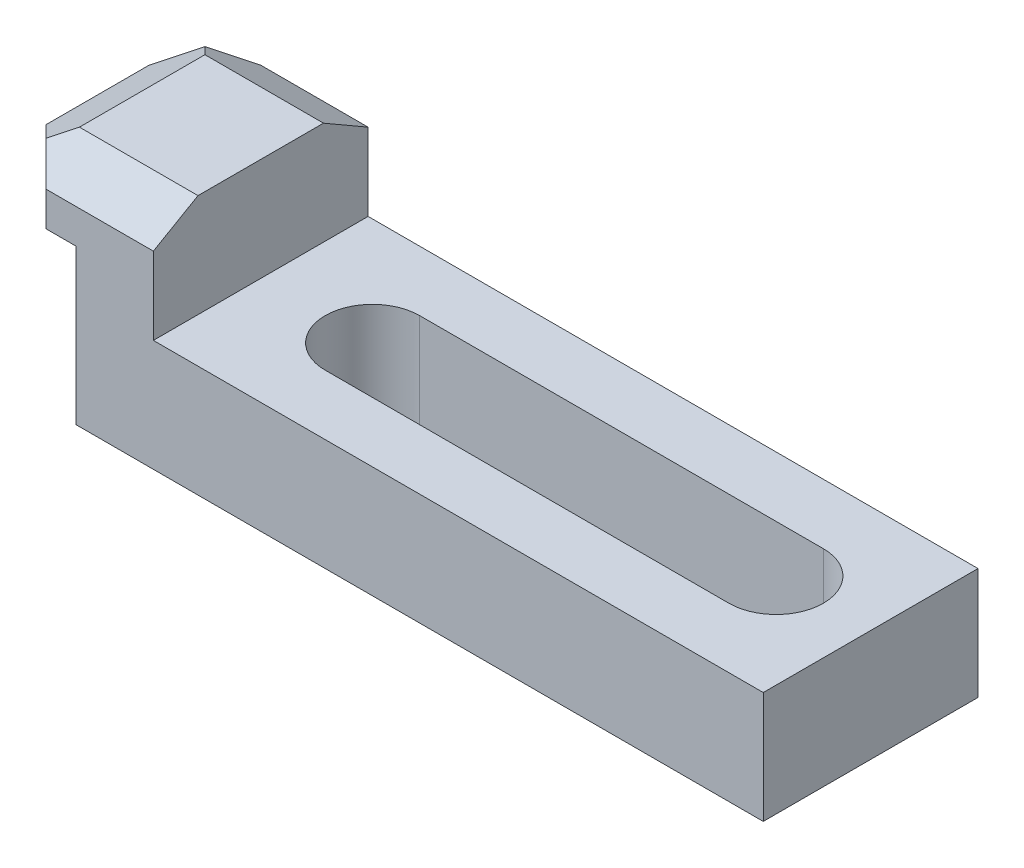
ISO-10303-21;
HEADER;
FILE_DESCRIPTION(('STEP AP214'),'2;1');
FILE_NAME('part.step','',(''),(''),'','','');
FILE_SCHEMA(('AUTOMOTIVE_DESIGN { 1 0 10303 214 1 1 1 1 }'));
ENDSEC;
DATA;
#1=APPLICATION_CONTEXT('core data for automotive mechanical design processes');
#2=APPLICATION_PROTOCOL_DEFINITION('international standard','automotive_design',2000,#1);
#3=PRODUCT_CONTEXT('',#1,'mechanical');
#4=PRODUCT('Part','Part','',(#3));
#5=PRODUCT_RELATED_PRODUCT_CATEGORY('part','',(#4));
#6=PRODUCT_DEFINITION_FORMATION('','',#4);
#7=PRODUCT_DEFINITION_CONTEXT('part definition',#1,'design');
#8=PRODUCT_DEFINITION('design','',#6,#7);
#9=PRODUCT_DEFINITION_SHAPE('','',#8);
#10=(LENGTH_UNIT() NAMED_UNIT(*) SI_UNIT(.MILLI.,.METRE.));
#11=(NAMED_UNIT(*) PLANE_ANGLE_UNIT() SI_UNIT($,.RADIAN.));
#12=(NAMED_UNIT(*) SI_UNIT($,.STERADIAN.) SOLID_ANGLE_UNIT());
#13=UNCERTAINTY_MEASURE_WITH_UNIT(LENGTH_MEASURE(1.E-05),#10,'distance_accuracy_value','');
#14=(GEOMETRIC_REPRESENTATION_CONTEXT(3) GLOBAL_UNCERTAINTY_ASSIGNED_CONTEXT((#13)) GLOBAL_UNIT_ASSIGNED_CONTEXT((#10,
#11,#12)) REPRESENTATION_CONTEXT('',''));
#15=CARTESIAN_POINT('',(0.,0.,0.));
#16=DIRECTION('',(0.,0.,1.));
#17=DIRECTION('',(1.,0.,0.));
#18=AXIS2_PLACEMENT_3D('',#15,#16,#17);
#19=CARTESIAN_POINT('',(0.,7.,12.5));
#20=DIRECTION('',(1.,0.,0.));
#21=DIRECTION('',(0.,1.,0.));
#22=AXIS2_PLACEMENT_3D('',#19,#20,#21);
#23=PLANE('',#22);
#24=DIRECTION('',(0.,0.,-1.));
#25=VECTOR('',#24,1.);
#26=CARTESIAN_POINT('',(0.,3.99999999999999,12.5));
#27=LINE('',#26,#25);
#28=CARTESIAN_POINT('',(0.,3.99999999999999,6.));
#29=VERTEX_POINT('',#28);
#30=CARTESIAN_POINT('',(0.,3.99999999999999,-6.));
#31=VERTEX_POINT('',#30);
#32=EDGE_CURVE('E171',#29,#31,#27,.T.);
#33=ORIENTED_EDGE('',*,*,#32,.T.);
#34=DIRECTION('',(0.,-1.,0.));
#35=VECTOR('',#34,1.);
#36=CARTESIAN_POINT('',(0.,7.,-6.));
#37=LINE('',#36,#35);
#38=CARTESIAN_POINT('',(0.,0.,-6.));
#39=VERTEX_POINT('',#38);
#40=EDGE_CURVE('E156',#31,#39,#37,.T.);
#41=ORIENTED_EDGE('',*,*,#40,.T.);
#42=DIRECTION('',(0.,0.,-1.));
#43=VECTOR('',#42,1.);
#44=CARTESIAN_POINT('',(0.,0.,12.5));
#45=LINE('',#44,#43);
#46=CARTESIAN_POINT('',(0.,0.,6.));
#47=VERTEX_POINT('',#46);
#48=EDGE_CURVE('E237',#47,#39,#45,.T.);
#49=ORIENTED_EDGE('',*,*,#48,.F.);
#50=DIRECTION('',(0.,-1.,0.));
#51=VECTOR('',#50,1.);
#52=CARTESIAN_POINT('',(0.,7.,6.));
#53=LINE('',#52,#51);
#54=EDGE_CURVE('E177',#29,#47,#53,.T.);
#55=ORIENTED_EDGE('',*,*,#54,.F.);
#56=EDGE_LOOP('',(#33,#41,#49,#55));
#57=FACE_BOUND('',#56,.T.);
#58=ADVANCED_FACE('F39',(#57),#23,.F.);
#59=CARTESIAN_POINT('',(0.,0.,12.5));
#60=DIRECTION('',(0.,1.,0.));
#61=DIRECTION('',(0.,0.,1.));
#62=AXIS2_PLACEMENT_3D('',#59,#60,#61);
#63=PLANE('',#62);
#64=ORIENTED_EDGE('',*,*,#48,.T.);
#65=DIRECTION('',(0.707106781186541,0.,-0.707106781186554));
#66=VECTOR('',#65,1.);
#67=CARTESIAN_POINT('',(-9.25,0.,3.25000000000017));
#68=LINE('',#67,#66);
#69=CARTESIAN_POINT('',(6.49999999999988,0.,-12.5));
#70=VERTEX_POINT('',#69);
#71=EDGE_CURVE('E159',#39,#70,#68,.T.);
#72=ORIENTED_EDGE('',*,*,#71,.T.);
#73=DIRECTION('',(1.,0.,0.));
#74=VECTOR('',#73,1.);
#75=CARTESIAN_POINT('',(0.,0.,-12.5));
#76=LINE('',#75,#74);
#77=CARTESIAN_POINT('',(10.,0.,-12.5));
#78=VERTEX_POINT('',#77);
#79=EDGE_CURVE('E198',#70,#78,#76,.T.);
#80=ORIENTED_EDGE('',*,*,#79,.T.);
#81=DIRECTION('',(0.,0.,-1.));
#82=VECTOR('',#81,1.);
#83=CARTESIAN_POINT('',(10.,0.,12.5));
#84=LINE('',#83,#82);
#85=CARTESIAN_POINT('',(10.,0.,12.5));
#86=VERTEX_POINT('',#85);
#87=EDGE_CURVE('E354',#86,#78,#84,.T.);
#88=ORIENTED_EDGE('',*,*,#87,.F.);
#89=DIRECTION('',(1.,0.,0.));
#90=VECTOR('',#89,1.);
#91=CARTESIAN_POINT('',(0.,0.,12.5));
#92=LINE('',#91,#90);
#93=CARTESIAN_POINT('',(6.49999999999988,0.,12.5));
#94=VERTEX_POINT('',#93);
#95=EDGE_CURVE('E310',#94,#86,#92,.T.);
#96=ORIENTED_EDGE('',*,*,#95,.F.);
#97=DIRECTION('',(-0.707106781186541,0.,-0.707106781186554));
#98=VECTOR('',#97,1.);
#99=CARTESIAN_POINT('',(3.25,0.,9.25000000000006));
#100=LINE('',#99,#98);
#101=EDGE_CURVE('E282',#94,#47,#100,.T.);
#102=ORIENTED_EDGE('',*,*,#101,.T.);
#103=EDGE_LOOP('',(#64,#72,#80,#88,#96,#102));
#104=FACE_BOUND('',#103,.T.);
#105=ADVANCED_FACE('F358',(#104),#63,.F.);
#106=CARTESIAN_POINT('',(10.,0.,12.5));
#107=DIRECTION('',(1.,0.,0.));
#108=DIRECTION('',(0.,1.,0.));
#109=AXIS2_PLACEMENT_3D('',#106,#107,#108);
#110=PLANE('',#109);
#111=DIRECTION('',(0.,-1.,0.));
#112=VECTOR('',#111,1.);
#113=CARTESIAN_POINT('',(10.,0.,-12.5));
#114=LINE('',#113,#112);
#115=CARTESIAN_POINT('',(10.,-18.,-12.5));
#116=VERTEX_POINT('',#115);
#117=EDGE_CURVE('E328',#78,#116,#114,.T.);
#118=ORIENTED_EDGE('',*,*,#117,.T.);
#119=DIRECTION('',(0.,0.,-1.));
#120=VECTOR('',#119,1.);
#121=CARTESIAN_POINT('',(10.,-18.,12.5));
#122=LINE('',#121,#120);
#123=CARTESIAN_POINT('',(10.,-18.,12.5));
#124=VERTEX_POINT('',#123);
#125=EDGE_CURVE('E351',#124,#116,#122,.T.);
#126=ORIENTED_EDGE('',*,*,#125,.F.);
#127=DIRECTION('',(0.,-1.,0.));
#128=VECTOR('',#127,1.);
#129=CARTESIAN_POINT('',(10.,0.,12.5));
#130=LINE('',#129,#128);
#131=EDGE_CURVE('E313',#86,#124,#130,.T.);
#132=ORIENTED_EDGE('',*,*,#131,.F.);
#133=ORIENTED_EDGE('',*,*,#87,.T.);
#134=EDGE_LOOP('',(#118,#126,#132,#133));
#135=FACE_BOUND('',#134,.T.);
#136=ADVANCED_FACE('F381',(#135),#110,.F.);
#137=CARTESIAN_POINT('',(10.,-18.,12.5));
#138=DIRECTION('',(0.,1.,0.));
#139=DIRECTION('',(0.,0.,1.));
#140=AXIS2_PLACEMENT_3D('',#137,#138,#139);
#141=PLANE('',#140);
#142=DIRECTION('',(1.,0.,0.));
#143=VECTOR('',#142,1.);
#144=CARTESIAN_POINT('',(32.,-18.,-5.5));
#145=LINE('',#144,#143);
#146=CARTESIAN_POINT('',(32.,-18.,-5.5));
#147=VERTEX_POINT('',#146);
#148=CARTESIAN_POINT('',(79.,-18.,-5.5));
#149=VERTEX_POINT('',#148);
#150=EDGE_CURVE('E288',#147,#149,#145,.T.);
#151=ORIENTED_EDGE('',*,*,#150,.F.);
#152=CARTESIAN_POINT('',(32.,-18.,0.));
#153=DIRECTION('',(0.,-1.,0.));
#154=DIRECTION('',(0.,0.,-1.));
#155=AXIS2_PLACEMENT_3D('',#152,#153,#154);
#156=CIRCLE('',#155,5.5);
#157=CARTESIAN_POINT('',(32.,-18.,5.5));
#158=VERTEX_POINT('',#157);
#159=EDGE_CURVE('E285',#158,#147,#156,.T.);
#160=ORIENTED_EDGE('',*,*,#159,.F.);
#161=DIRECTION('',(-1.,0.,0.));
#162=VECTOR('',#161,1.);
#163=CARTESIAN_POINT('',(32.,-18.,5.5));
#164=LINE('',#163,#162);
#165=CARTESIAN_POINT('',(79.,-18.,5.5));
#166=VERTEX_POINT('',#165);
#167=EDGE_CURVE('E296',#166,#158,#164,.T.);
#168=ORIENTED_EDGE('',*,*,#167,.F.);
#169=CARTESIAN_POINT('',(79.,-18.,0.));
#170=DIRECTION('',(0.,-1.,0.));
#171=DIRECTION('',(0.,0.,-1.));
#172=AXIS2_PLACEMENT_3D('',#169,#170,#171);
#173=CIRCLE('',#172,5.5);
#174=EDGE_CURVE('E292',#149,#166,#173,.T.);
#175=ORIENTED_EDGE('',*,*,#174,.F.);
#176=EDGE_LOOP('',(#151,#160,#168,#175));
#177=FACE_BOUND('',#176,.T.);
#178=DIRECTION('',(1.,0.,0.));
#179=VECTOR('',#178,1.);
#180=CARTESIAN_POINT('',(10.,-18.,-12.5));
#181=LINE('',#180,#179);
#182=CARTESIAN_POINT('',(90.,-18.,-12.5));
#183=VERTEX_POINT('',#182);
#184=EDGE_CURVE('E331',#116,#183,#181,.T.);
#185=ORIENTED_EDGE('',*,*,#184,.T.);
#186=DIRECTION('',(0.,0.,-1.));
#187=VECTOR('',#186,1.);
#188=CARTESIAN_POINT('',(90.,-18.,12.5));
#189=LINE('',#188,#187);
#190=CARTESIAN_POINT('',(90.,-18.,12.5));
#191=VERTEX_POINT('',#190);
#192=EDGE_CURVE('E347',#191,#183,#189,.T.);
#193=ORIENTED_EDGE('',*,*,#192,.F.);
#194=DIRECTION('',(1.,0.,0.));
#195=VECTOR('',#194,1.);
#196=CARTESIAN_POINT('',(10.,-18.,12.5));
#197=LINE('',#196,#195);
#198=EDGE_CURVE('E315',#124,#191,#197,.T.);
#199=ORIENTED_EDGE('',*,*,#198,.F.);
#200=ORIENTED_EDGE('',*,*,#125,.T.);
#201=EDGE_LOOP('',(#185,#193,#199,#200));
#202=FACE_BOUND('',#201,.T.);
#203=ADVANCED_FACE('F378',(#177,#202),#141,.F.);
#204=CARTESIAN_POINT('',(90.,-18.,12.5));
#205=DIRECTION('',(-1.,0.,0.));
#206=DIRECTION('',(0.,0.,1.));
#207=AXIS2_PLACEMENT_3D('',#204,#205,#206);
#208=PLANE('',#207);
#209=DIRECTION('',(0.,1.,0.));
#210=VECTOR('',#209,1.);
#211=CARTESIAN_POINT('',(90.,-18.,-12.5));
#212=LINE('',#211,#210);
#213=CARTESIAN_POINT('',(90.,-5.,-12.5));
#214=VERTEX_POINT('',#213);
#215=EDGE_CURVE('E334',#183,#214,#212,.T.);
#216=ORIENTED_EDGE('',*,*,#215,.T.);
#217=DIRECTION('',(0.,0.,-1.));
#218=VECTOR('',#217,1.);
#219=CARTESIAN_POINT('',(90.,-5.,12.5));
#220=LINE('',#219,#218);
#221=CARTESIAN_POINT('',(90.,-5.,12.5));
#222=VERTEX_POINT('',#221);
#223=EDGE_CURVE('E344',#222,#214,#220,.T.);
#224=ORIENTED_EDGE('',*,*,#223,.F.);
#225=DIRECTION('',(0.,1.,0.));
#226=VECTOR('',#225,1.);
#227=CARTESIAN_POINT('',(90.,-18.,12.5));
#228=LINE('',#227,#226);
#229=EDGE_CURVE('E317',#191,#222,#228,.T.);
#230=ORIENTED_EDGE('',*,*,#229,.F.);
#231=ORIENTED_EDGE('',*,*,#192,.T.);
#232=EDGE_LOOP('',(#216,#224,#230,#231));
#233=FACE_BOUND('',#232,.T.);
#234=ADVANCED_FACE('F374',(#233),#208,.F.);
#235=CARTESIAN_POINT('',(90.,-5.,12.5));
#236=DIRECTION('',(0.,-1.,0.));
#237=DIRECTION('',(1.,0.,0.));
#238=AXIS2_PLACEMENT_3D('',#235,#236,#237);
#239=PLANE('',#238);
#240=DIRECTION('',(-1.,0.,0.));
#241=VECTOR('',#240,1.);
#242=CARTESIAN_POINT('',(90.,-5.,5.5));
#243=LINE('',#242,#241);
#244=CARTESIAN_POINT('',(79.,-5.,5.5));
#245=VERTEX_POINT('',#244);
#246=CARTESIAN_POINT('',(32.,-5.,5.5));
#247=VERTEX_POINT('',#246);
#248=EDGE_CURVE('E203',#245,#247,#243,.T.);
#249=ORIENTED_EDGE('',*,*,#248,.T.);
#250=CARTESIAN_POINT('',(32.,-5.00000000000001,0.));
#251=DIRECTION('',(0.,-1.,0.));
#252=DIRECTION('',(1.,0.,0.));
#253=AXIS2_PLACEMENT_3D('',#250,#251,#252);
#254=CIRCLE('',#253,5.5);
#255=CARTESIAN_POINT('',(32.,-5.,-5.5));
#256=VERTEX_POINT('',#255);
#257=EDGE_CURVE('E207',#247,#256,#254,.T.);
#258=ORIENTED_EDGE('',*,*,#257,.T.);
#259=DIRECTION('',(1.,0.,0.));
#260=VECTOR('',#259,1.);
#261=CARTESIAN_POINT('',(90.,-5.,-5.5));
#262=LINE('',#261,#260);
#263=CARTESIAN_POINT('',(79.,-5.,-5.5));
#264=VERTEX_POINT('',#263);
#265=EDGE_CURVE('E179',#256,#264,#262,.T.);
#266=ORIENTED_EDGE('',*,*,#265,.T.);
#267=CARTESIAN_POINT('',(79.,-5.,0.));
#268=DIRECTION('',(0.,-1.,0.));
#269=DIRECTION('',(1.,0.,0.));
#270=AXIS2_PLACEMENT_3D('',#267,#268,#269);
#271=CIRCLE('',#270,5.5);
#272=EDGE_CURVE('E185',#264,#245,#271,.T.);
#273=ORIENTED_EDGE('',*,*,#272,.T.);
#274=EDGE_LOOP('',(#249,#258,#266,#273));
#275=FACE_BOUND('',#274,.T.);
#276=DIRECTION('',(-1.,0.,0.));
#277=VECTOR('',#276,1.);
#278=CARTESIAN_POINT('',(90.,-5.,-12.5));
#279=LINE('',#278,#277);
#280=CARTESIAN_POINT('',(19.,-5.00000000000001,-12.5));
#281=VERTEX_POINT('',#280);
#282=EDGE_CURVE('E337',#214,#281,#279,.T.);
#283=ORIENTED_EDGE('',*,*,#282,.T.);
#284=DIRECTION('',(0.,0.,-1.));
#285=VECTOR('',#284,1.);
#286=CARTESIAN_POINT('',(19.,-5.00000000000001,12.5));
#287=LINE('',#286,#285);
#288=CARTESIAN_POINT('',(19.,-5.00000000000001,12.5));
#289=VERTEX_POINT('',#288);
#290=EDGE_CURVE('E259',#289,#281,#287,.T.);
#291=ORIENTED_EDGE('',*,*,#290,.F.);
#292=DIRECTION('',(-1.,0.,0.));
#293=VECTOR('',#292,1.);
#294=CARTESIAN_POINT('',(90.,-5.,12.5));
#295=LINE('',#294,#293);
#296=EDGE_CURVE('E320',#222,#289,#295,.T.);
#297=ORIENTED_EDGE('',*,*,#296,.F.);
#298=ORIENTED_EDGE('',*,*,#223,.T.);
#299=EDGE_LOOP('',(#283,#291,#297,#298));
#300=FACE_BOUND('',#299,.T.);
#301=ADVANCED_FACE('F370',(#275,#300),#239,.F.);
#302=CARTESIAN_POINT('',(19.,-5.00000000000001,12.5));
#303=DIRECTION('',(-1.,0.,0.));
#304=DIRECTION('',(0.,-1.,0.));
#305=AXIS2_PLACEMENT_3D('',#302,#303,#304);
#306=PLANE('',#305);
#307=DIRECTION('',(0.,1.,0.));
#308=VECTOR('',#307,1.);
#309=CARTESIAN_POINT('',(19.,-5.00000000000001,-12.5));
#310=LINE('',#309,#308);
#311=CARTESIAN_POINT('',(19.,3.99999999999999,-12.5));
#312=VERTEX_POINT('',#311);
#313=EDGE_CURVE('E253',#281,#312,#310,.T.);
#314=ORIENTED_EDGE('',*,*,#313,.T.);
#315=DIRECTION('',(0.,-0.500000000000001,-0.866025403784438));
#316=VECTOR('',#315,1.);
#317=CARTESIAN_POINT('',(19.,7.,-7.30384757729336));
#318=LINE('',#317,#316);
#319=CARTESIAN_POINT('',(19.,7.,-7.30384757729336));
#320=VERTEX_POINT('',#319);
#321=EDGE_CURVE('E189',#312,#320,#318,.F.);
#322=ORIENTED_EDGE('',*,*,#321,.T.);
#323=DIRECTION('',(0.,0.,-1.));
#324=VECTOR('',#323,1.);
#325=CARTESIAN_POINT('',(19.,7.,12.5));
#326=LINE('',#325,#324);
#327=CARTESIAN_POINT('',(19.,7.,7.30384757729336));
#328=VERTEX_POINT('',#327);
#329=EDGE_CURVE('E250',#328,#320,#326,.T.);
#330=ORIENTED_EDGE('',*,*,#329,.F.);
#331=DIRECTION('',(0.,-0.500000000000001,0.866025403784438));
#332=VECTOR('',#331,1.);
#333=CARTESIAN_POINT('',(19.,3.99999999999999,12.5));
#334=LINE('',#333,#332);
#335=CARTESIAN_POINT('',(19.,3.99999999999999,12.5));
#336=VERTEX_POINT('',#335);
#337=EDGE_CURVE('E222',#328,#336,#334,.T.);
#338=ORIENTED_EDGE('',*,*,#337,.T.);
#339=DIRECTION('',(0.,1.,0.));
#340=VECTOR('',#339,1.);
#341=CARTESIAN_POINT('',(19.,-5.00000000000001,12.5));
#342=LINE('',#341,#340);
#343=EDGE_CURVE('E260',#289,#336,#342,.T.);
#344=ORIENTED_EDGE('',*,*,#343,.F.);
#345=ORIENTED_EDGE('',*,*,#290,.T.);
#346=EDGE_LOOP('',(#314,#322,#330,#338,#344,#345));
#347=FACE_BOUND('',#346,.T.);
#348=ADVANCED_FACE('F249',(#347),#306,.F.);
#349=CARTESIAN_POINT('',(19.,7.,12.5));
#350=DIRECTION('',(0.,-1.,0.));
#351=DIRECTION('',(1.,0.,0.));
#352=AXIS2_PLACEMENT_3D('',#349,#350,#351);
#353=PLANE('',#352);
#354=ORIENTED_EDGE('',*,*,#329,.T.);
#355=DIRECTION('',(-1.,0.,0.));
#356=VECTOR('',#355,1.);
#357=CARTESIAN_POINT('',(19.,7.,-7.30384757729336));
#358=LINE('',#357,#356);
#359=CARTESIAN_POINT('',(5.19615242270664,7.,-7.30384757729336));
#360=VERTEX_POINT('',#359);
#361=EDGE_CURVE('E227',#320,#360,#358,.T.);
#362=ORIENTED_EDGE('',*,*,#361,.T.);
#363=DIRECTION('',(0.,0.,1.));
#364=VECTOR('',#363,1.);
#365=CARTESIAN_POINT('',(5.19615242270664,7.,12.5));
#366=LINE('',#365,#364);
#367=CARTESIAN_POINT('',(5.19615242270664,7.,7.30384757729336));
#368=VERTEX_POINT('',#367);
#369=EDGE_CURVE('E228',#360,#368,#366,.T.);
#370=ORIENTED_EDGE('',*,*,#369,.T.);
#371=DIRECTION('',(1.,0.,0.));
#372=VECTOR('',#371,1.);
#373=CARTESIAN_POINT('',(19.,7.,7.30384757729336));
#374=LINE('',#373,#372);
#375=EDGE_CURVE('E221',#368,#328,#374,.T.);
#376=ORIENTED_EDGE('',*,*,#375,.T.);
#377=EDGE_LOOP('',(#354,#362,#370,#376));
#378=FACE_BOUND('',#377,.T.);
#379=ADVANCED_FACE('F257',(#378),#353,.F.);
#380=CARTESIAN_POINT('',(0.,0.,12.5));
#381=DIRECTION('',(0.,0.,1.));
#382=DIRECTION('',(1.,0.,0.));
#383=AXIS2_PLACEMENT_3D('',#380,#381,#382);
#384=PLANE('',#383);
#385=DIRECTION('',(0.,-1.,0.));
#386=VECTOR('',#385,1.);
#387=CARTESIAN_POINT('',(6.49999999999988,7.,12.5));
#388=LINE('',#387,#386);
#389=CARTESIAN_POINT('',(6.49999999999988,3.99999999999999,12.5));
#390=VERTEX_POINT('',#389);
#391=EDGE_CURVE('E274',#390,#94,#388,.T.);
#392=ORIENTED_EDGE('',*,*,#391,.T.);
#393=ORIENTED_EDGE('',*,*,#95,.T.);
#394=ORIENTED_EDGE('',*,*,#131,.T.);
#395=ORIENTED_EDGE('',*,*,#198,.T.);
#396=ORIENTED_EDGE('',*,*,#229,.T.);
#397=ORIENTED_EDGE('',*,*,#296,.T.);
#398=ORIENTED_EDGE('',*,*,#343,.T.);
#399=DIRECTION('',(-1.,0.,0.));
#400=VECTOR('',#399,1.);
#401=CARTESIAN_POINT('',(0.,3.99999999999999,12.5));
#402=LINE('',#401,#400);
#403=EDGE_CURVE('E180',#336,#390,#402,.T.);
#404=ORIENTED_EDGE('',*,*,#403,.T.);
#405=EDGE_LOOP('',(#392,#393,#394,#395,#396,#397,#398,#404));
#406=FACE_BOUND('',#405,.T.);
#407=ADVANCED_FACE('F362',(#406),#384,.T.);
#408=CARTESIAN_POINT('',(0.,0.,-12.5));
#409=DIRECTION('',(0.,0.,1.));
#410=DIRECTION('',(1.,0.,0.));
#411=AXIS2_PLACEMENT_3D('',#408,#409,#410);
#412=PLANE('',#411);
#413=ORIENTED_EDGE('',*,*,#79,.F.);
#414=DIRECTION('',(0.,-1.,0.));
#415=VECTOR('',#414,1.);
#416=CARTESIAN_POINT('',(6.49999999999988,7.,-12.5));
#417=LINE('',#416,#415);
#418=CARTESIAN_POINT('',(6.49999999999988,3.99999999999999,-12.5));
#419=VERTEX_POINT('',#418);
#420=EDGE_CURVE('E165',#419,#70,#417,.T.);
#421=ORIENTED_EDGE('',*,*,#420,.F.);
#422=DIRECTION('',(1.,0.,0.));
#423=VECTOR('',#422,1.);
#424=CARTESIAN_POINT('',(0.,3.99999999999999,-12.5));
#425=LINE('',#424,#423);
#426=EDGE_CURVE('E234',#419,#312,#425,.T.);
#427=ORIENTED_EDGE('',*,*,#426,.T.);
#428=ORIENTED_EDGE('',*,*,#313,.F.);
#429=ORIENTED_EDGE('',*,*,#282,.F.);
#430=ORIENTED_EDGE('',*,*,#215,.F.);
#431=ORIENTED_EDGE('',*,*,#184,.F.);
#432=ORIENTED_EDGE('',*,*,#117,.F.);
#433=EDGE_LOOP('',(#413,#421,#427,#428,#429,#430,#431,#432));
#434=FACE_BOUND('',#433,.T.);
#435=ADVANCED_FACE('F266',(#434),#412,.F.);
#436=CARTESIAN_POINT('',(0.,3.99999999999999,12.5));
#437=DIRECTION('',(0.,0.866025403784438,0.500000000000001));
#438=DIRECTION('',(0.,-0.500000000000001,0.866025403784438));
#439=AXIS2_PLACEMENT_3D('',#436,#437,#438);
#440=PLANE('',#439);
#441=DIRECTION('',(-0.65465367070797,0.377964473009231,-0.654653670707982));
#442=VECTOR('',#441,1.);
#443=CARTESIAN_POINT('',(3.71428571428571,5.60833289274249,9.71428571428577));
#444=LINE('',#443,#442);
#445=CARTESIAN_POINT('',(3.24999999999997,5.87638837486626,9.25000000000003));
#446=VERTEX_POINT('',#445);
#447=EDGE_CURVE('E62',#390,#446,#444,.T.);
#448=ORIENTED_EDGE('',*,*,#447,.F.);
#449=ORIENTED_EDGE('',*,*,#403,.F.);
#450=ORIENTED_EDGE('',*,*,#337,.F.);
#451=ORIENTED_EDGE('',*,*,#375,.F.);
#452=DIRECTION('',(-0.654653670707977,-0.377964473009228,0.654653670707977));
#453=VECTOR('',#452,1.);
#454=CARTESIAN_POINT('',(0.,3.99999999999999,12.5));
#455=LINE('',#454,#453);
#456=EDGE_CURVE('E195',#446,#368,#455,.F.);
#457=ORIENTED_EDGE('',*,*,#456,.F.);
#458=EDGE_LOOP('',(#448,#449,#450,#451,#457));
#459=FACE_BOUND('',#458,.T.);
#460=ADVANCED_FACE('F41',(#459),#440,.T.);
#461=CARTESIAN_POINT('',(0.,3.99999999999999,12.5));
#462=DIRECTION('',(0.5,-0.866025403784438,0.));
#463=DIRECTION('',(0.866025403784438,0.5,0.));
#464=AXIS2_PLACEMENT_3D('',#461,#462,#463);
#465=PLANE('',#464);
#466=DIRECTION('',(-0.654653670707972,-0.377964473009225,0.654653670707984));
#467=VECTOR('',#466,1.);
#468=CARTESIAN_POINT('',(-7.92857142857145,-0.577562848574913,1.92857142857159));
#469=LINE('',#468,#467);
#470=CARTESIAN_POINT('',(3.24999999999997,5.87638837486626,-9.25000000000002));
#471=VERTEX_POINT('',#470);
#472=EDGE_CURVE('E54',#31,#471,#469,.F.);
#473=ORIENTED_EDGE('',*,*,#472,.F.);
#474=ORIENTED_EDGE('',*,*,#32,.F.);
#475=DIRECTION('',(0.654653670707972,0.377964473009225,0.654653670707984));
#476=VECTOR('',#475,1.);
#477=CARTESIAN_POINT('',(2.78571428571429,5.60833289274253,8.78571428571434));
#478=LINE('',#477,#476);
#479=EDGE_CURVE('E48',#446,#29,#478,.F.);
#480=ORIENTED_EDGE('',*,*,#479,.F.);
#481=ORIENTED_EDGE('',*,*,#456,.T.);
#482=ORIENTED_EDGE('',*,*,#369,.F.);
#483=DIRECTION('',(-0.654653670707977,-0.377964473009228,-0.654653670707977));
#484=VECTOR('',#483,1.);
#485=CARTESIAN_POINT('',(10.7142857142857,10.1858957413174,-1.78571428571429));
#486=LINE('',#485,#484);
#487=EDGE_CURVE('E173',#471,#360,#486,.F.);
#488=ORIENTED_EDGE('',*,*,#487,.F.);
#489=EDGE_LOOP('',(#473,#474,#480,#481,#482,#488));
#490=FACE_BOUND('',#489,.T.);
#491=ADVANCED_FACE('F170',(#490),#465,.F.);
#492=CARTESIAN_POINT('',(19.,7.,-7.30384757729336));
#493=DIRECTION('',(0.,-0.866025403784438,0.500000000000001));
#494=DIRECTION('',(0.,-0.500000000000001,-0.866025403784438));
#495=AXIS2_PLACEMENT_3D('',#492,#493,#494);
#496=PLANE('',#495);
#497=DIRECTION('',(-0.65465367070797,0.377964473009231,0.654653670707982));
#498=VECTOR('',#497,1.);
#499=CARTESIAN_POINT('',(8.88791290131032,2.62133784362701,-14.8879129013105));
#500=LINE('',#499,#498);
#501=EDGE_CURVE('E11',#471,#419,#500,.F.);
#502=ORIENTED_EDGE('',*,*,#501,.F.);
#503=ORIENTED_EDGE('',*,*,#487,.T.);
#504=ORIENTED_EDGE('',*,*,#361,.F.);
#505=ORIENTED_EDGE('',*,*,#321,.F.);
#506=ORIENTED_EDGE('',*,*,#426,.F.);
#507=EDGE_LOOP('',(#502,#503,#504,#505,#506));
#508=FACE_BOUND('',#507,.T.);
#509=ADVANCED_FACE('F262',(#508),#496,.F.);
#510=CARTESIAN_POINT('',(32.,7.,0.));
#511=DIRECTION('',(0.,-1.,0.));
#512=DIRECTION('',(0.,0.,-1.));
#513=AXIS2_PLACEMENT_3D('',#510,#511,#512);
#514=CYLINDRICAL_SURFACE('',#513,5.5);
#515=DIRECTION('',(0.,-1.,0.));
#516=VECTOR('',#515,1.);
#517=CARTESIAN_POINT('',(32.,7.,5.5));
#518=LINE('',#517,#516);
#519=EDGE_CURVE('E196',#247,#158,#518,.T.);
#520=ORIENTED_EDGE('',*,*,#519,.T.);
#521=ORIENTED_EDGE('',*,*,#159,.T.);
#522=DIRECTION('',(0.,-1.,0.));
#523=VECTOR('',#522,1.);
#524=CARTESIAN_POINT('',(32.,7.,-5.5));
#525=LINE('',#524,#523);
#526=EDGE_CURVE('E300',#256,#147,#525,.T.);
#527=ORIENTED_EDGE('',*,*,#526,.F.);
#528=ORIENTED_EDGE('',*,*,#257,.F.);
#529=EDGE_LOOP('',(#520,#521,#527,#528));
#530=FACE_BOUND('',#529,.T.);
#531=ADVANCED_FACE('F398',(#530),#514,.F.);
#532=CARTESIAN_POINT('',(32.,7.,5.5));
#533=DIRECTION('',(0.,0.,1.));
#534=DIRECTION('',(1.,0.,0.));
#535=AXIS2_PLACEMENT_3D('',#532,#533,#534);
#536=PLANE('',#535);
#537=DIRECTION('',(0.,-1.,0.));
#538=VECTOR('',#537,1.);
#539=CARTESIAN_POINT('',(79.,7.,5.5));
#540=LINE('',#539,#538);
#541=EDGE_CURVE('E302',#245,#166,#540,.T.);
#542=ORIENTED_EDGE('',*,*,#541,.T.);
#543=ORIENTED_EDGE('',*,*,#167,.T.);
#544=ORIENTED_EDGE('',*,*,#519,.F.);
#545=ORIENTED_EDGE('',*,*,#248,.F.);
#546=EDGE_LOOP('',(#542,#543,#544,#545));
#547=FACE_BOUND('',#546,.T.);
#548=ADVANCED_FACE('F458',(#547),#536,.F.);
#549=CARTESIAN_POINT('',(79.,7.,0.));
#550=DIRECTION('',(0.,-1.,0.));
#551=DIRECTION('',(0.,0.,-1.));
#552=AXIS2_PLACEMENT_3D('',#549,#550,#551);
#553=CYLINDRICAL_SURFACE('',#552,5.5);
#554=DIRECTION('',(0.,-1.,0.));
#555=VECTOR('',#554,1.);
#556=CARTESIAN_POINT('',(79.,7.,-5.5));
#557=LINE('',#556,#555);
#558=EDGE_CURVE('E304',#264,#149,#557,.T.);
#559=ORIENTED_EDGE('',*,*,#558,.T.);
#560=ORIENTED_EDGE('',*,*,#174,.T.);
#561=ORIENTED_EDGE('',*,*,#541,.F.);
#562=ORIENTED_EDGE('',*,*,#272,.F.);
#563=EDGE_LOOP('',(#559,#560,#561,#562));
#564=FACE_BOUND('',#563,.T.);
#565=ADVANCED_FACE('F466',(#564),#553,.F.);
#566=CARTESIAN_POINT('',(32.,7.,-5.5));
#567=DIRECTION('',(0.,0.,-1.));
#568=DIRECTION('',(-1.,0.,0.));
#569=AXIS2_PLACEMENT_3D('',#566,#567,#568);
#570=PLANE('',#569);
#571=ORIENTED_EDGE('',*,*,#526,.T.);
#572=ORIENTED_EDGE('',*,*,#150,.T.);
#573=ORIENTED_EDGE('',*,*,#558,.F.);
#574=ORIENTED_EDGE('',*,*,#265,.F.);
#575=EDGE_LOOP('',(#571,#572,#573,#574));
#576=FACE_BOUND('',#575,.T.);
#577=ADVANCED_FACE('F475',(#576),#570,.F.);
#578=CARTESIAN_POINT('',(6.49999999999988,7.,12.5));
#579=DIRECTION('',(0.707106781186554,0.,-0.707106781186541));
#580=DIRECTION('',(-0.707106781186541,0.,-0.707106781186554));
#581=AXIS2_PLACEMENT_3D('',#578,#579,#580);
#582=PLANE('',#581);
#583=ORIENTED_EDGE('',*,*,#391,.F.);
#584=ORIENTED_EDGE('',*,*,#447,.T.);
#585=ORIENTED_EDGE('',*,*,#479,.T.);
#586=ORIENTED_EDGE('',*,*,#54,.T.);
#587=ORIENTED_EDGE('',*,*,#101,.F.);
#588=EDGE_LOOP('',(#583,#584,#585,#586,#587));
#589=FACE_BOUND('',#588,.T.);
#590=ADVANCED_FACE('F213',(#589),#582,.F.);
#591=CARTESIAN_POINT('',(6.49999999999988,7.,-12.5));
#592=DIRECTION('',(0.707106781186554,0.,0.707106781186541));
#593=DIRECTION('',(0.707106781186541,0.,-0.707106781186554));
#594=AXIS2_PLACEMENT_3D('',#591,#592,#593);
#595=PLANE('',#594);
#596=ORIENTED_EDGE('',*,*,#40,.F.);
#597=ORIENTED_EDGE('',*,*,#472,.T.);
#598=ORIENTED_EDGE('',*,*,#501,.T.);
#599=ORIENTED_EDGE('',*,*,#420,.T.);
#600=ORIENTED_EDGE('',*,*,#71,.F.);
#601=EDGE_LOOP('',(#596,#597,#598,#599,#600));
#602=FACE_BOUND('',#601,.T.);
#603=ADVANCED_FACE('F157',(#602),#595,.F.);
#604=CLOSED_SHELL('',(#58,#105,#136,#203,#234,#301,#348,#379,#407,#435,#460,#491,#509,#531,#548,
#565,#577,#590,#603));
#605=MANIFOLD_SOLID_BREP('B2',#604);
#606=ADVANCED_BREP_SHAPE_REPRESENTATION('',(#18,#605),#14);
#607=SHAPE_DEFINITION_REPRESENTATION(#9,#606);
ENDSEC;
END-ISO-10303-21;
